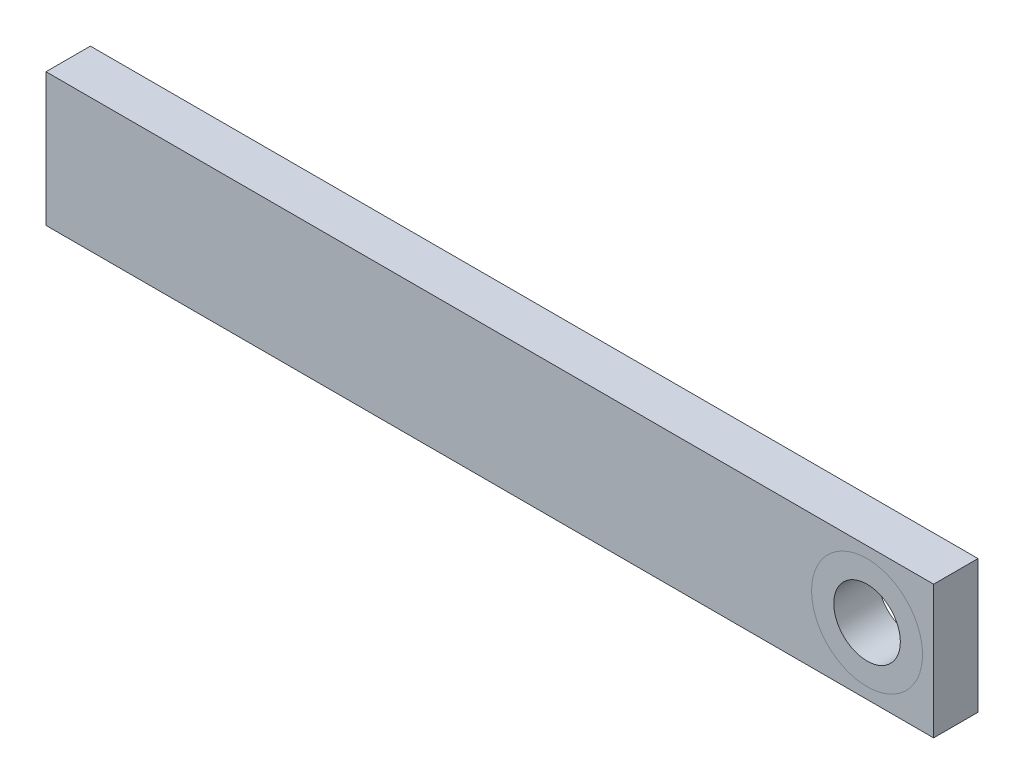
from build123d import *

# Parameters (mm, degrees)
SKETCH1_W          = 200
SKETCH1_H          = 30
BASE_EXTRUDE_DEPTH = 10
SKETCH2_R          = 7.5
CUT_EXTRUDE1_DEPTH = 203.484567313


with BuildPart() as part:
    # Sketch1 → Base-Extrude (new body)
    with BuildSketch(Plane.XY):
        with Locations((100, 15)):
            Rectangle(SKETCH1_W, SKETCH1_H)
    extrude(amount=BASE_EXTRUDE_DEPTH)

    # Sketch2 → Cut-Extrude1 (cut, through all)
    with BuildSketch(Plane.XY.offset(10)):
        with Locations((185, 15)):
            Circle(SKETCH2_R)
    extrude(amount=-CUT_EXTRUDE1_DEPTH, mode=Mode.SUBTRACT)


solid = part.part
